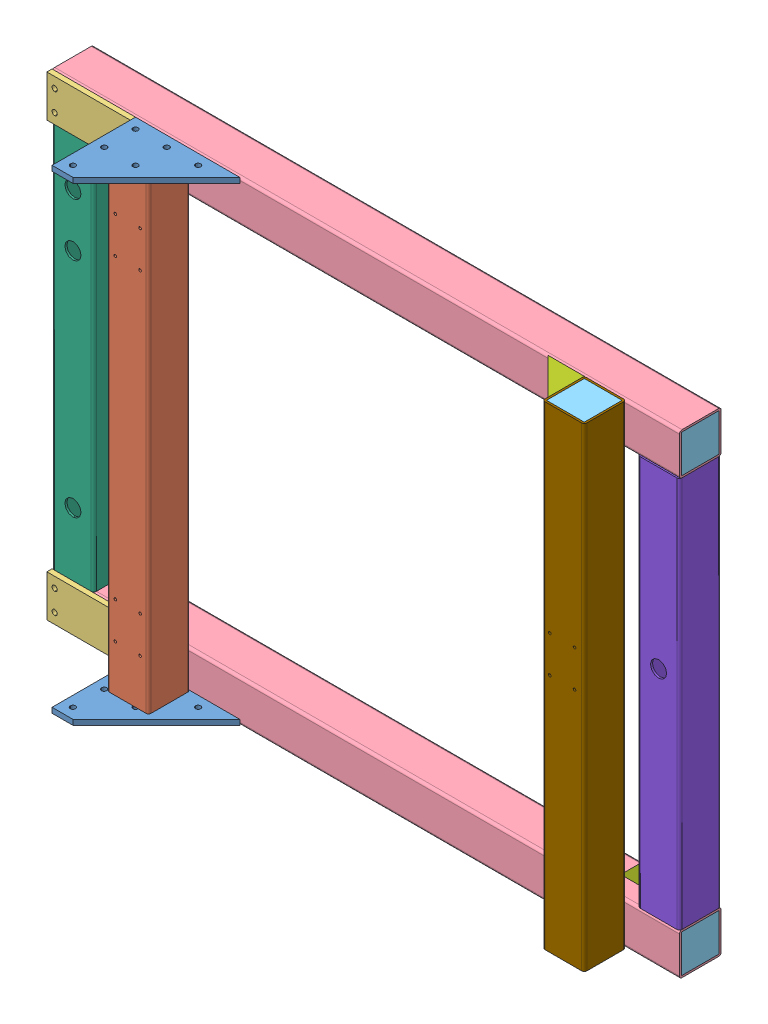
SolidWorks assembly 1080-C1005 OSIRIS Support Frame Weldment, K1.SLDASM, configuration Default (file format 5000). Lengths in mm.
Overall size (1527.81 1155.7 304.8).
24 component instances, 9 part files, 31 mates.
Components (placement in the parent):
- OS-F0106 LIFT SUPPORT GUSSET-1: OS-F0106 LIFT SUPPORT GUSSET.SLDPRT [Default] at (-1013.5208 -560.4374 420.2386) size (254 12.7 203.2)
- OS-F0106 LIFT SUPPORT GUSSET-2: OS-F0106 LIFT SUPPORT GUSSET.SLDPRT [Default] at (-1013.5208 582.5626 420.2386) size (254 12.7 203.2)
- OS-F0105 MIDDLE UPPER CROSS MEMBER-1: OS-F0105 MIDDLE UPPER CROSS MEMBER.SLDPRT [Default] at (-1057.971 11.0626 369.4386) size (101.6 1130.3 101.6)
- OS-F0107 LIFT BOLT-DOWN PLATE-1: OS-F0107 LIFT BOLT-DOWN PLATE.SLDPRT [Default] at (-1226.2459 -515.9874 324.9886) size (234.95 101.6 12.7)
- OS-F0107 LIFT BOLT-DOWN PLATE-2: OS-F0107 LIFT BOLT-DOWN PLATE.SLDPRT [Default] at (-1226.2459 538.1126 324.9886) x (1 0 0) z (0 0 -1) size (234.95 101.6 12.7)
- 1080-C1016 LONGITUDINAL MEMBER-1: 1080-C1016 LONGITUDINAL MEMBER.SLDPRT [Default] at (-873.1237 -515.9874 267.8386) size (1527.81 101.6 101.6)
- 1080-C1012 END COVER-1: 1080-C1012 END COVER.SLDPRT [Default] at (-1343.7208 -515.9874 267.8386) x (0 1 0) z (1 0 0) size (92.08 92.08 4.76)
- 1080-C1015 REAR CROSS MEMBER-1: 1080-C1015 REAR CROSS MEMBER.SLDASM [Default] at (-1292.9208 11.0626 267.8386) x (0 0 1) z (0 1 0) size (101.6 190.5 952.5)
  - 1080-C1014 4x4 REAR TUBE CROSS-1: 1080-C1014 4x4 REAR TUBE CROSS.SLDPRT [Default] at origin size (101.6 101.6 952.5)
  - 1080-C1013 GUSSET-1: 1080-C1013 GUSSET.SLDPRT [Default] at (-3.175 50.8 -387.35) x (0 0 -1) z (1 0 0) size (88.9 88.9 6.35)
  - 1080-C1013 GUSSET-2: 1080-C1013 GUSSET.SLDPRT [Default] at (3.175 50.8 387.35) x (0 0 1) z (-1 0 0) size (88.9 88.9 6.35)
- 1080-C1016 LONGITUDINAL MEMBER-2: 1080-C1016 LONGITUDINAL MEMBER.SLDPRT [Default] at (-873.1237 538.1126 267.8386) size (1527.81 101.6 101.6)
- 1080-C1012 END COVER-3: 1080-C1012 END COVER.SLDPRT [Default] at (-1343.7208 538.1126 267.8386) x (0 1 0) z (1 0 0) size (92.08 92.08 4.76)
- 1080-C1010 FRONT CROSS MEMBER-1: 1080-C1010 FRONT CROSS MEMBER.SLDASM [Default] at (133.2243 11.0626 267.8386) x (0 0 -1) z (0 1 0) size (101.6 190.5 952.5)
  - 1080-C1011 4x4 TUBE CROSS-1: 1080-C1011 4x4 TUBE CROSS.SLDPRT [Default] at origin size (101.6 101.6 952.5)
  - 1080-C1013 GUSSET-1: 1080-C1013 GUSSET.SLDPRT [Default] at (-3.175 50.8 -387.35) x (0 0 -1) z (1 0 0) size (88.9 88.9 6.35)
  - 1080-C1013 GUSSET-2: 1080-C1013 GUSSET.SLDPRT [Default] at (3.175 50.8 387.35) x (0 0 1) z (-1 0 0) size (88.9 88.9 6.35)
- 1080-C1012 END COVER-4: 1080-C1012 END COVER.SLDPRT [Default] at (179.2618 -515.9874 267.8386) x (0 1 0) z (1 0 0) size (92.08 92.08 4.76)
- 1080-C1012 END COVER-5: 1080-C1012 END COVER.SLDPRT [Default] at (179.2618 538.1126 267.8386) x (0 1 0) z (1 0 0) size (92.08 92.08 4.76)
- OS-F0104 FRONT UPPER CROSS-MEMBER-1: OS-F0104 FRONT UPPER CROSS-MEMBER.SLDPRT [Default] at (3.1763 11.0626 369.4386) size (101.6 1155.7 101.6)
- 1080-C1012 END COVER-6: 1080-C1012 END COVER.SLDPRT [Default] at (3.1763 -562.0249 369.4386) x (1 0 0) z (0 -1 0) size (92.08 92.08 4.76)
- 1080-C1013 GUSSET-1: 1080-C1013 GUSSET.SLDPRT [Default] at (-136.5237 -560.4374 318.6386) x (1 0 0) z (0 -1 0) size (88.9 88.9 6.35)
- 1080-C1012 END COVER-7: 1080-C1012 END COVER.SLDPRT [Default] at (3.1763 584.1501 369.4386) x (1 0 0) z (0 1 0) size (92.08 92.08 4.76)
- 1080-C1013 GUSSET-2: 1080-C1013 GUSSET.SLDPRT [Default] at (-136.5237 588.9126 318.6386) x (1 0 0) z (0 -1 0) size (88.9 88.9 6.35)
Mates (geometry in assembly coordinates):
- Coincident37: coincident anti-aligned: plane of 1080-C1012 END COVER-1 through (-1338.9583 -562.0249 312.2886) normal (0 -1 0); plane of 1080-C1016 LONGITUDINAL MEMBER-1 through (-1101.7237 -562.0249 223.3886) normal (0 1 0)
- Coincident38: coincident anti-aligned: plane of 1080-C1012 END COVER-1 through (-1338.9583 -560.4374 221.8011) normal (0 0 -1); plane of 1080-C1016 LONGITUDINAL MEMBER-1 through (-1101.7237 -471.5374 221.8011) normal (0 0 1)
- Coincident42: coincident anti-aligned: plane of 1080-C1015 REAR CROSS MEMBER-1/1080-C1014 4x4 REAR TUBE CROSS-1 through (-1248.4708 487.3126 318.6386) normal (0 0 1); plane of OS-F0105 MIDDLE UPPER CROSS MEMBER-1 through (-1013.521 576.2126 318.6386) normal (0 0 -1)
- Coincident34: coincident anti-aligned: plane of 1080-C1012 END COVER-3 through (-1338.9583 584.1501 312.2886) normal (0 1 0); plane of 1080-C1016 LONGITUDINAL MEMBER-2 through (-1101.7237 584.1501 312.2886) normal (0 -1 0)
- Coincident35: coincident anti-aligned: plane of 1080-C1012 END COVER-3 through (-1338.9583 493.6626 221.8011) normal (0 0 -1); plane of 1080-C1016 LONGITUDINAL MEMBER-2 through (-1101.7237 582.5626 221.8011) normal (0 0 1)
- Coincident28: coincident anti-aligned: plane of ? through (88.7743 487.3126 312.2886) normal (0 1 0); plane of 1080-C1016 LONGITUDINAL MEMBER-2 through (-1101.7237 487.3126 223.3886) normal (0 -1 0)
- Coincident84: coincident aligned: plane of 1080-C1016 LONGITUDINAL MEMBER-1 through (184.0243 -560.4374 223.3886) normal (1 0 0); plane of 1080-C1012 END COVER-4 through (184.0243 -560.4374 312.2886) normal (1 0 0)
- Coincident85: coincident anti-aligned: plane of 1080-C1016 LONGITUDINAL MEMBER-1 through (-1101.7237 -471.5374 221.8011) normal (0 0 1); plane of 1080-C1012 END COVER-4 through (184.0243 -560.4374 221.8011) normal (0 0 -1)
- Coincident86: coincident anti-aligned: plane of 1080-C1016 LONGITUDINAL MEMBER-1 through (-1101.7237 -469.9499 312.2886) normal (0 -1 0); plane of 1080-C1012 END COVER-4 through (184.0243 -469.9499 312.2886) normal (0 1 0)
- Coincident87: coincident aligned: plane of 1080-C1016 LONGITUDINAL MEMBER-2 through (184.0243 493.6626 223.3886) normal (1 0 0); plane of 1080-C1012 END COVER-5 through (184.0243 493.6626 312.2886) normal (1 0 0)
- Coincident88: coincident anti-aligned: plane of 1080-C1016 LONGITUDINAL MEMBER-2 through (-1101.7237 582.5626 221.8011) normal (0 0 1); plane of 1080-C1012 END COVER-5 through (184.0243 493.6626 221.8011) normal (0 0 -1)
- Coincident89: coincident anti-aligned: plane of 1080-C1016 LONGITUDINAL MEMBER-2 through (-1101.7237 492.0751 223.3886) normal (0 1 0); plane of 1080-C1012 END COVER-5 through (184.0243 492.0751 312.2886) normal (0 -1 0)
- Distance34: distance = 130.048 mm aligned: plane of 1080-C1010 FRONT CROSS MEMBER-1/1080-C1011 4x4 TUBE CROSS-1 through (184.0243 487.3126 312.2886) normal (1 0 0); plane of OS-F0104 FRONT UPPER CROSS-MEMBER-1 through (53.9763 588.9126 413.8886) normal (1 0 0)
- Coincident30: coincident anti-aligned: plane of 1080-C1010 FRONT CROSS MEMBER-1/1080-C1011 4x4 TUBE CROSS-1 through (88.7743 555.271 318.6386) normal (0 0 1); plane of OS-F0104 FRONT UPPER CROSS-MEMBER-1 through (47.6263 588.9126 318.6386) normal (0 0 -1)
- Coincident90: coincident aligned: plane of 1080-C1015 REAR CROSS MEMBER-1/1080-C1014 4x4 REAR TUBE CROSS-1 through (-1343.7208 487.3126 223.3886) normal (-1 0 0); plane of 1080-C1012 END COVER-3 through (-1343.7208 493.6626 312.2886) normal (-1 0 0)
- Coincident91: coincident anti-aligned: plane of OS-F0107 LIFT BOLT-DOWN PLATE-2 through (-1140.5208 588.9126 318.6386) normal (0 0 -1); plane of 1080-C1016 LONGITUDINAL MEMBER-2 through (-1101.7237 493.6626 318.6386) normal (0 0 1)
- Coincident92: coincident anti-aligned: plane of OS-F0106 LIFT SUPPORT GUSSET-2 through (-1115.1208 576.2126 420.2386) normal (0 -1 0); plane of OS-F0107 LIFT BOLT-DOWN PLATE-2 through (-1140.5208 576.2126 331.3386) normal (0 1 0)
- Coincident93: coincident aligned: plane of OS-F0107 LIFT BOLT-DOWN PLATE-2 through (-1343.7208 487.3126 331.3386) normal (-1 0 0); plane of 1080-C1012 END COVER-3 through (-1343.7208 493.6626 312.2886) normal (-1 0 0)
- Coincident94: coincident anti-aligned: plane of OS-F0104 FRONT UPPER CROSS-MEMBER-1 through (47.6263 588.9126 323.4011) normal (0 0 1); plane of 1080-C1012 END COVER-6 through (-41.2737 -566.7874 323.4011) normal (0 0 -1)
- Coincident95: coincident anti-aligned: plane of OS-F0104 FRONT UPPER CROSS-MEMBER-1 through (-42.8612 588.9126 324.9886) normal (1 0 0); plane of 1080-C1012 END COVER-6 through (-42.8612 -566.7874 413.8886) normal (-1 0 0)
- Coincident96: coincident aligned: plane of OS-F0104 FRONT UPPER CROSS-MEMBER-1 through (-41.2737 -566.7874 318.6386) normal (0 -1 0); plane of 1080-C1012 END COVER-6 through (-41.2737 -566.7874 413.8886) normal (0 -1 0)
- Coincident97: coincident anti-aligned: plane of OS-F0104 FRONT UPPER CROSS-MEMBER-1 through (-47.6237 588.9126 324.9886) normal (-1 0 0); plane of 1080-C1013 GUSSET-1 through (-47.6237 -566.7874 318.6386) normal (1 0 0)
- Coincident98: coincident aligned: plane of OS-F0104 FRONT UPPER CROSS-MEMBER-1 through (47.6263 588.9126 318.6386) normal (0 0 -1); plane of 1080-C1013 GUSSET-1 through (-136.5237 -566.7874 318.6386) normal (0 0 -1)
- Coincident99: coincident aligned: plane of OS-F0104 FRONT UPPER CROSS-MEMBER-1 through (-41.2737 -566.7874 318.6386) normal (0 -1 0); plane of 1080-C1013 GUSSET-1 through (-136.5237 -566.7874 318.6386) normal (0 -1 0)
- Coincident100: coincident anti-aligned: plane of OS-F0104 FRONT UPPER CROSS-MEMBER-1 through (47.6263 588.9126 323.4011) normal (0 0 1); plane of 1080-C1012 END COVER-7 through (-41.2737 588.9126 323.4011) normal (0 0 -1)
- Coincident101: coincident anti-aligned: plane of OS-F0104 FRONT UPPER CROSS-MEMBER-1 through (49.2138 588.9126 413.8886) normal (-1 0 0); plane of 1080-C1012 END COVER-7 through (49.2138 588.9126 324.9886) normal (1 0 0)
- Coincident102: coincident aligned: plane of OS-F0104 FRONT UPPER CROSS-MEMBER-1 through (3.1763 588.9126 369.4386) normal (0 1 0); plane of 1080-C1012 END COVER-7 through (-41.2737 588.9126 324.9886) normal (0 1 0)
- Coincident103: coincident anti-aligned: plane of OS-F0104 FRONT UPPER CROSS-MEMBER-1 through (-47.6237 588.9126 324.9886) normal (-1 0 0); plane of 1080-C1013 GUSSET-2 through (-47.6237 582.5626 318.6386) normal (1 0 0)
- Coincident104: coincident aligned: plane of OS-F0104 FRONT UPPER CROSS-MEMBER-1 through (47.6263 588.9126 318.6386) normal (0 0 -1); plane of 1080-C1013 GUSSET-2 through (-136.5237 582.5626 318.6386) normal (0 0 -1)
- Coincident105: coincident aligned: plane of OS-F0104 FRONT UPPER CROSS-MEMBER-1 through (3.1763 588.9126 369.4386) normal (0 1 0); plane of 1080-C1013 GUSSET-2 through (-136.5237 588.9126 318.6386) normal (0 1 0)
- Coincident106: coincident anti-aligned: plane of 1080-C1016 LONGITUDINAL MEMBER-1 through (-1101.7237 -465.1874 312.2886) normal (0 1 0); plane of 1080-C1010 FRONT CROSS MEMBER-1/1080-C1011 4x4 TUBE CROSS-1 through (88.7743 -465.1874 312.2886) normal (0 -1 0)
